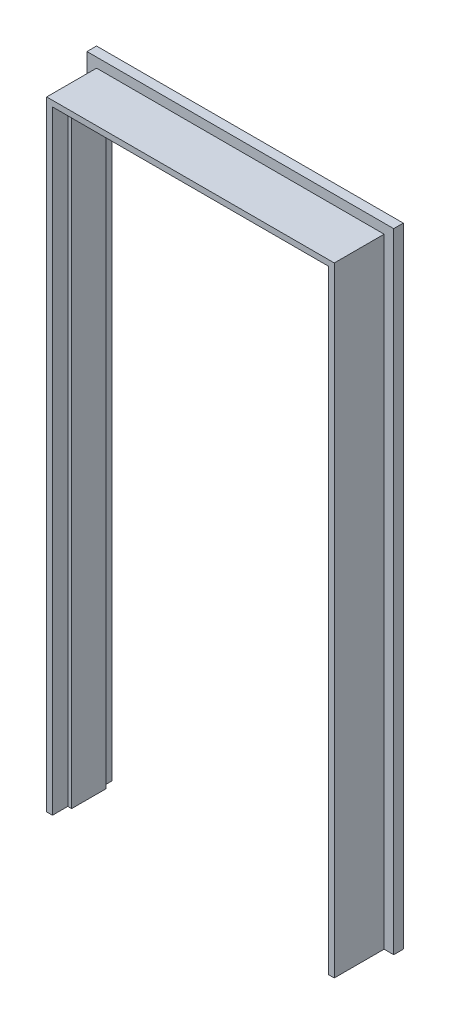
from build123d import *

# Parameters (mm, degrees)
FRAME_DEPTH             = 165.1
EXT_BRICK_MOLDING_DEPTH = 31.75
DOOR_STOP_MOLDING_DEPTH = 114.3


with BuildPart() as part:
    # Sketch1 → Frame (new body)
    with BuildSketch(Plane.XY):
        Polygon((-476.25, 0), (-476.25, 2051.05), (476.25, 2051.05), (476.25, 0), (457.2, 0), (457.2, 2032), (-457.2, 2032), (-457.2, 0), align=None)
    extrude(amount=FRAME_DEPTH)



with BuildPart() as body_2:
    # Sketch2 → Ext Brick Molding (new body)
    with BuildSketch(Plane(origin=(0, 0, 0), x_dir=(-1, 0, 0), z_dir=(0, 0, -1))):
        Polygon((-457.2, 0), (-457.2, 2032), (457.2, 2032), (457.2, 0), (508, 0), (508, 2082.8), (-508, 2082.8), (-508, 0), align=None)
    extrude(amount=EXT_BRICK_MOLDING_DEPTH)


with BuildPart() as part_1:
    add(part.part)

    add(body_2.part)  # Door Stop Molding merges body 2
    # Sketch3 → Door Stop Molding (add)
    with BuildSketch(Plane.XY):
        Polygon((-444.5, 0), (-444.5, 2019.3), (444.5, 2019.3), (444.5, 0), (457.2, 0), (457.2, 2032), (-457.2, 2032), (-457.2, 0), align=None)
    extrude(amount=DOOR_STOP_MOLDING_DEPTH)


solid = part_1.part
